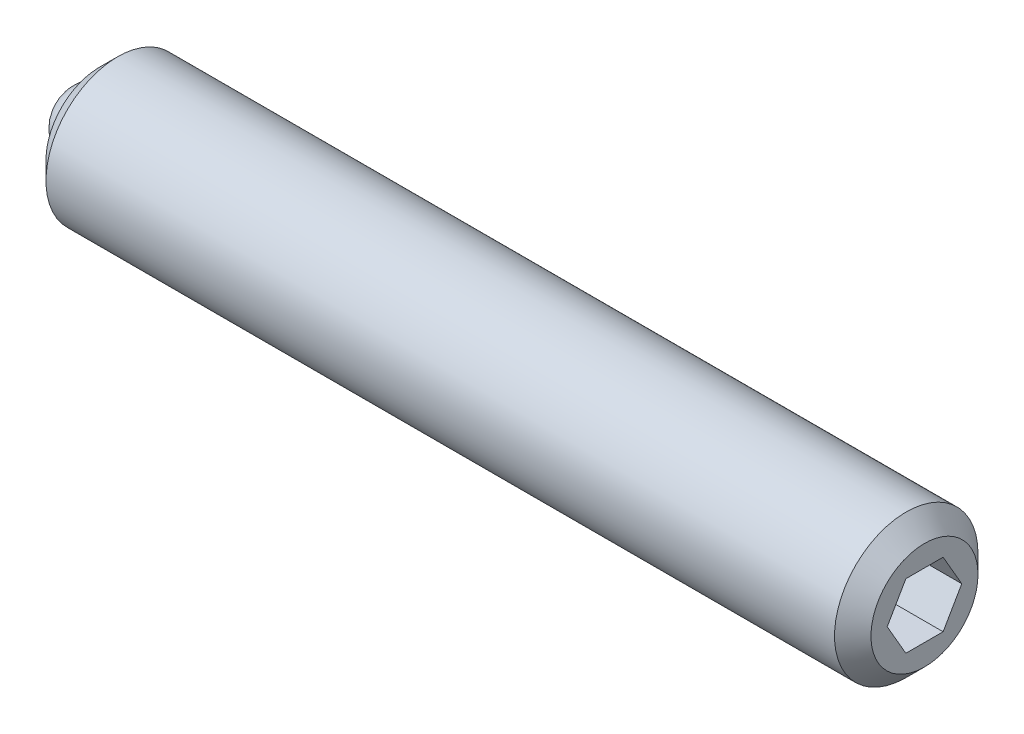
ISO-10303-21;
HEADER;
FILE_DESCRIPTION(('STEP AP214'),'2;1');
FILE_NAME('part.step','',(''),(''),'','','');
FILE_SCHEMA(('AUTOMOTIVE_DESIGN { 1 0 10303 214 1 1 1 1 }'));
ENDSEC;
DATA;
#1=APPLICATION_CONTEXT('core data for automotive mechanical design processes');
#2=APPLICATION_PROTOCOL_DEFINITION('international standard','automotive_design',2000,#1);
#3=PRODUCT_CONTEXT('',#1,'mechanical');
#4=PRODUCT('Part','Part','',(#3));
#5=PRODUCT_RELATED_PRODUCT_CATEGORY('part','',(#4));
#6=PRODUCT_DEFINITION_FORMATION('','',#4);
#7=PRODUCT_DEFINITION_CONTEXT('part definition',#1,'design');
#8=PRODUCT_DEFINITION('design','',#6,#7);
#9=PRODUCT_DEFINITION_SHAPE('','',#8);
#10=(LENGTH_UNIT() NAMED_UNIT(*) SI_UNIT(.MILLI.,.METRE.));
#11=(NAMED_UNIT(*) PLANE_ANGLE_UNIT() SI_UNIT($,.RADIAN.));
#12=(NAMED_UNIT(*) SI_UNIT($,.STERADIAN.) SOLID_ANGLE_UNIT());
#13=UNCERTAINTY_MEASURE_WITH_UNIT(LENGTH_MEASURE(1.E-05),#10,'distance_accuracy_value','');
#14=(GEOMETRIC_REPRESENTATION_CONTEXT(3) GLOBAL_UNCERTAINTY_ASSIGNED_CONTEXT((#13)) GLOBAL_UNIT_ASSIGNED_CONTEXT((#10,
#11,#12)) REPRESENTATION_CONTEXT('',''));
#15=CARTESIAN_POINT('',(0.,0.,0.));
#16=DIRECTION('',(0.,0.,1.));
#17=DIRECTION('',(1.,0.,0.));
#18=AXIS2_PLACEMENT_3D('',#15,#16,#17);
#19=CARTESIAN_POINT('',(0.,0.,0.));
#20=DIRECTION('',(0.,-1.,0.));
#21=DIRECTION('',(0.,0.,-1.));
#22=AXIS2_PLACEMENT_3D('',#19,#20,#21);
#23=SPHERICAL_SURFACE('',#22,0.5);
#24=CARTESIAN_POINT('',(0.,-0.5,0.));
#25=VERTEX_POINT('',#24);
#26=VERTEX_LOOP('',#25);
#27=FACE_BOUND('',#26,.T.);
#28=ADVANCED_FACE('F41',(#27),#23,.T.);
#29=CLOSED_SHELL('',(#28));
#30=MANIFOLD_SOLID_BREP('B2',#29);
#31=CARTESIAN_POINT('',(11.5,0.,0.));
#32=DIRECTION('',(-1.,0.,0.));
#33=DIRECTION('',(0.,0.,1.));
#34=AXIS2_PLACEMENT_3D('',#31,#32,#33);
#35=CYLINDRICAL_SURFACE('',#34,1.);
#36=CARTESIAN_POINT('',(11.246,0.,0.));
#37=DIRECTION('',(1.,0.,0.));
#38=DIRECTION('',(0.,0.,-1.));
#39=AXIS2_PLACEMENT_3D('',#36,#37,#38);
#40=CIRCLE('',#39,1.);
#41=CARTESIAN_POINT('',(11.246,0.,-1.));
#42=VERTEX_POINT('',#41);
#43=EDGE_CURVE('E39',#42,#42,#40,.F.);
#44=ORIENTED_EDGE('',*,*,#43,.T.);
#45=EDGE_LOOP('',(#44));
#46=FACE_BOUND('',#45,.T.);
#47=CARTESIAN_POINT('',(0.254000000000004,0.,0.));
#48=DIRECTION('',(1.,0.,0.));
#49=DIRECTION('',(0.,0.,-1.));
#50=AXIS2_PLACEMENT_3D('',#47,#48,#49);
#51=CIRCLE('',#50,1.);
#52=CARTESIAN_POINT('',(0.254000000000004,0.,-1.));
#53=VERTEX_POINT('',#52);
#54=EDGE_CURVE('E157',#53,#53,#51,.T.);
#55=ORIENTED_EDGE('',*,*,#54,.T.);
#56=EDGE_LOOP('',(#55));
#57=FACE_BOUND('',#56,.T.);
#58=ADVANCED_FACE('F54',(#46,#57),#35,.T.);
#59=CARTESIAN_POINT('',(11.5,0.,0.));
#60=DIRECTION('',(1.,0.,0.));
#61=DIRECTION('',(0.,0.,-1.));
#62=AXIS2_PLACEMENT_3D('',#59,#60,#61);
#63=PLANE('',#62);
#64=DIRECTION('',(0.,0.866025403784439,-0.5));
#65=VECTOR('',#64,1.);
#66=CARTESIAN_POINT('',(11.5,-0.45,-0.259807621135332));
#67=LINE('',#66,#65);
#68=CARTESIAN_POINT('',(11.5,-0.45,-0.259807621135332));
#69=VERTEX_POINT('',#68);
#70=CARTESIAN_POINT('',(11.5,0.,-0.519615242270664));
#71=VERTEX_POINT('',#70);
#72=EDGE_CURVE('E69',#69,#71,#67,.T.);
#73=ORIENTED_EDGE('',*,*,#72,.F.);
#74=DIRECTION('',(0.,0.,-1.));
#75=VECTOR('',#74,1.);
#76=CARTESIAN_POINT('',(11.5,-0.45,0.259807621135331));
#77=LINE('',#76,#75);
#78=CARTESIAN_POINT('',(11.5,-0.45,0.259807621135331));
#79=VERTEX_POINT('',#78);
#80=EDGE_CURVE('E153',#79,#69,#77,.T.);
#81=ORIENTED_EDGE('',*,*,#80,.F.);
#82=DIRECTION('',(0.,-0.866025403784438,-0.5));
#83=VECTOR('',#82,1.);
#84=CARTESIAN_POINT('',(11.5,0.,0.519615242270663));
#85=LINE('',#84,#83);
#86=CARTESIAN_POINT('',(11.5,0.,0.519615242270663));
#87=VERTEX_POINT('',#86);
#88=EDGE_CURVE('E151',#87,#79,#85,.T.);
#89=ORIENTED_EDGE('',*,*,#88,.F.);
#90=DIRECTION('',(0.,-0.866025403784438,0.5));
#91=VECTOR('',#90,1.);
#92=CARTESIAN_POINT('',(11.5,0.45,0.259807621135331));
#93=LINE('',#92,#91);
#94=CARTESIAN_POINT('',(11.5,0.45,0.259807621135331));
#95=VERTEX_POINT('',#94);
#96=EDGE_CURVE('E117',#95,#87,#93,.T.);
#97=ORIENTED_EDGE('',*,*,#96,.F.);
#98=DIRECTION('',(0.,0.,1.));
#99=VECTOR('',#98,1.);
#100=CARTESIAN_POINT('',(11.5,0.45,-0.259807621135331));
#101=LINE('',#100,#99);
#102=CARTESIAN_POINT('',(11.5,0.45,-0.259807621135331));
#103=VERTEX_POINT('',#102);
#104=EDGE_CURVE('E147',#103,#95,#101,.T.);
#105=ORIENTED_EDGE('',*,*,#104,.F.);
#106=DIRECTION('',(0.,0.866025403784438,0.5));
#107=VECTOR('',#106,1.);
#108=CARTESIAN_POINT('',(11.5,0.,-0.519615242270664));
#109=LINE('',#108,#107);
#110=EDGE_CURVE('E143',#71,#103,#109,.T.);
#111=ORIENTED_EDGE('',*,*,#110,.F.);
#112=EDGE_LOOP('',(#73,#81,#89,#97,#105,#111));
#113=FACE_BOUND('',#112,.T.);
#114=CARTESIAN_POINT('',(11.5,0.,0.));
#115=DIRECTION('',(1.,0.,0.));
#116=DIRECTION('',(0.,0.,-1.));
#117=AXIS2_PLACEMENT_3D('',#114,#115,#116);
#118=CIRCLE('',#117,0.745999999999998);
#119=CARTESIAN_POINT('',(11.5,0.,-0.745999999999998));
#120=VERTEX_POINT('',#119);
#121=EDGE_CURVE('E62',#120,#120,#118,.T.);
#122=ORIENTED_EDGE('',*,*,#121,.T.);
#123=EDGE_LOOP('',(#122));
#124=FACE_BOUND('',#123,.T.);
#125=ADVANCED_FACE('F170',(#113,#124),#63,.T.);
#126=CARTESIAN_POINT('',(0.,0.,0.));
#127=DIRECTION('',(1.,0.,0.));
#128=DIRECTION('',(0.,0.,-1.));
#129=AXIS2_PLACEMENT_3D('',#126,#127,#128);
#130=PLANE('',#129);
#131=CARTESIAN_POINT('',(0.,0.,0.));
#132=DIRECTION('',(-1.,0.,0.));
#133=DIRECTION('',(0.,0.,1.));
#134=AXIS2_PLACEMENT_3D('',#131,#132,#133);
#135=CIRCLE('',#134,0.5);
#136=CARTESIAN_POINT('',(0.,0.,0.5));
#137=VERTEX_POINT('',#136);
#138=EDGE_CURVE('E225',#137,#137,#135,.T.);
#139=ORIENTED_EDGE('',*,*,#138,.F.);
#140=EDGE_LOOP('',(#139));
#141=FACE_BOUND('',#140,.T.);
#142=CARTESIAN_POINT('',(0.,0.,0.));
#143=DIRECTION('',(1.,0.,0.));
#144=DIRECTION('',(0.,0.,-1.));
#145=AXIS2_PLACEMENT_3D('',#142,#143,#144);
#146=CIRCLE('',#145,0.745999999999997);
#147=CARTESIAN_POINT('',(0.,0.,-0.745999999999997));
#148=VERTEX_POINT('',#147);
#149=EDGE_CURVE('E165',#148,#148,#146,.F.);
#150=ORIENTED_EDGE('',*,*,#149,.T.);
#151=EDGE_LOOP('',(#150));
#152=FACE_BOUND('',#151,.T.);
#153=ADVANCED_FACE('F182',(#141,#152),#130,.F.);
#154=CARTESIAN_POINT('',(0.254000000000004,0.,0.));
#155=DIRECTION('',(1.,0.,0.));
#156=DIRECTION('',(0.,0.,-1.));
#157=AXIS2_PLACEMENT_3D('',#154,#155,#156);
#158=CONICAL_SURFACE('',#157,1.,0.785398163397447);
#159=ORIENTED_EDGE('',*,*,#149,.F.);
#160=EDGE_LOOP('',(#159));
#161=FACE_BOUND('',#160,.T.);
#162=ORIENTED_EDGE('',*,*,#54,.F.);
#163=EDGE_LOOP('',(#162));
#164=FACE_BOUND('',#163,.T.);
#165=ADVANCED_FACE('F174',(#161,#164),#158,.T.);
#166=CARTESIAN_POINT('',(11.5,0.,0.));
#167=DIRECTION('',(-1.,0.,0.));
#168=DIRECTION('',(0.,0.,1.));
#169=AXIS2_PLACEMENT_3D('',#166,#167,#168);
#170=CONICAL_SURFACE('',#169,0.745999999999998,0.785398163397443);
#171=ORIENTED_EDGE('',*,*,#43,.F.);
#172=EDGE_LOOP('',(#171));
#173=FACE_BOUND('',#172,.T.);
#174=ORIENTED_EDGE('',*,*,#121,.F.);
#175=EDGE_LOOP('',(#174));
#176=FACE_BOUND('',#175,.T.);
#177=ADVANCED_FACE('F56',(#173,#176),#170,.T.);
#178=CARTESIAN_POINT('',(9.5,-0.45,-0.259807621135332));
#179=DIRECTION('',(0.,-0.5,-0.866025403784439));
#180=DIRECTION('',(0.,0.866025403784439,-0.5));
#181=AXIS2_PLACEMENT_3D('',#178,#179,#180);
#182=PLANE('',#181);
#183=ORIENTED_EDGE('',*,*,#72,.T.);
#184=DIRECTION('',(1.,0.,0.));
#185=VECTOR('',#184,1.);
#186=CARTESIAN_POINT('',(9.5,0.,-0.519615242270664));
#187=LINE('',#186,#185);
#188=CARTESIAN_POINT('',(9.5,0.,-0.519615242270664));
#189=VERTEX_POINT('',#188);
#190=EDGE_CURVE('E99',#189,#71,#187,.T.);
#191=ORIENTED_EDGE('',*,*,#190,.F.);
#192=DIRECTION('',(0.,0.866025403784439,-0.5));
#193=VECTOR('',#192,1.);
#194=CARTESIAN_POINT('',(9.5,-0.45,-0.259807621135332));
#195=LINE('',#194,#193);
#196=CARTESIAN_POINT('',(9.5,-0.45,-0.259807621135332));
#197=VERTEX_POINT('',#196);
#198=EDGE_CURVE('E155',#197,#189,#195,.T.);
#199=ORIENTED_EDGE('',*,*,#198,.F.);
#200=DIRECTION('',(1.,0.,0.));
#201=VECTOR('',#200,1.);
#202=CARTESIAN_POINT('',(9.5,-0.45,-0.259807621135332));
#203=LINE('',#202,#201);
#204=EDGE_CURVE('E77',#197,#69,#203,.T.);
#205=ORIENTED_EDGE('',*,*,#204,.T.);
#206=EDGE_LOOP('',(#183,#191,#199,#205));
#207=FACE_BOUND('',#206,.T.);
#208=ADVANCED_FACE('F173',(#207),#182,.F.);
#209=CARTESIAN_POINT('',(9.5,-0.45,0.259807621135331));
#210=DIRECTION('',(0.,-1.,0.));
#211=DIRECTION('',(0.,0.,-1.));
#212=AXIS2_PLACEMENT_3D('',#209,#210,#211);
#213=PLANE('',#212);
#214=ORIENTED_EDGE('',*,*,#80,.T.);
#215=ORIENTED_EDGE('',*,*,#204,.F.);
#216=DIRECTION('',(0.,0.,-1.));
#217=VECTOR('',#216,1.);
#218=CARTESIAN_POINT('',(9.5,-0.45,0.259807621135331));
#219=LINE('',#218,#217);
#220=CARTESIAN_POINT('',(9.5,-0.45,0.259807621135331));
#221=VERTEX_POINT('',#220);
#222=EDGE_CURVE('E129',#221,#197,#219,.T.);
#223=ORIENTED_EDGE('',*,*,#222,.F.);
#224=DIRECTION('',(1.,0.,0.));
#225=VECTOR('',#224,1.);
#226=CARTESIAN_POINT('',(9.5,-0.45,0.259807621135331));
#227=LINE('',#226,#225);
#228=EDGE_CURVE('E121',#221,#79,#227,.T.);
#229=ORIENTED_EDGE('',*,*,#228,.T.);
#230=EDGE_LOOP('',(#214,#215,#223,#229));
#231=FACE_BOUND('',#230,.T.);
#232=ADVANCED_FACE('F180',(#231),#213,.F.);
#233=CARTESIAN_POINT('',(9.5,0.,0.519615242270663));
#234=DIRECTION('',(0.,-0.5,0.866025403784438));
#235=DIRECTION('',(0.,-0.866025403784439,-0.5));
#236=AXIS2_PLACEMENT_3D('',#233,#234,#235);
#237=PLANE('',#236);
#238=ORIENTED_EDGE('',*,*,#88,.T.);
#239=ORIENTED_EDGE('',*,*,#228,.F.);
#240=DIRECTION('',(0.,-0.866025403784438,-0.5));
#241=VECTOR('',#240,1.);
#242=CARTESIAN_POINT('',(9.5,0.,0.519615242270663));
#243=LINE('',#242,#241);
#244=CARTESIAN_POINT('',(9.5,0.,0.519615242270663));
#245=VERTEX_POINT('',#244);
#246=EDGE_CURVE('E125',#245,#221,#243,.T.);
#247=ORIENTED_EDGE('',*,*,#246,.F.);
#248=DIRECTION('',(1.,0.,0.));
#249=VECTOR('',#248,1.);
#250=CARTESIAN_POINT('',(9.5,0.,0.519615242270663));
#251=LINE('',#250,#249);
#252=EDGE_CURVE('E110',#245,#87,#251,.T.);
#253=ORIENTED_EDGE('',*,*,#252,.T.);
#254=EDGE_LOOP('',(#238,#239,#247,#253));
#255=FACE_BOUND('',#254,.T.);
#256=ADVANCED_FACE('F126',(#255),#237,.F.);
#257=CARTESIAN_POINT('',(9.5,0.45,0.259807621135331));
#258=DIRECTION('',(0.,0.5,0.866025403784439));
#259=DIRECTION('',(0.,-0.866025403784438,0.5));
#260=AXIS2_PLACEMENT_3D('',#257,#258,#259);
#261=PLANE('',#260);
#262=ORIENTED_EDGE('',*,*,#96,.T.);
#263=ORIENTED_EDGE('',*,*,#252,.F.);
#264=DIRECTION('',(0.,-0.866025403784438,0.5));
#265=VECTOR('',#264,1.);
#266=CARTESIAN_POINT('',(9.5,0.45,0.259807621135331));
#267=LINE('',#266,#265);
#268=CARTESIAN_POINT('',(9.5,0.45,0.259807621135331));
#269=VERTEX_POINT('',#268);
#270=EDGE_CURVE('E114',#269,#245,#267,.T.);
#271=ORIENTED_EDGE('',*,*,#270,.F.);
#272=DIRECTION('',(1.,0.,0.));
#273=VECTOR('',#272,1.);
#274=CARTESIAN_POINT('',(9.5,0.45,0.259807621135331));
#275=LINE('',#274,#273);
#276=EDGE_CURVE('E122',#269,#95,#275,.T.);
#277=ORIENTED_EDGE('',*,*,#276,.T.);
#278=EDGE_LOOP('',(#262,#263,#271,#277));
#279=FACE_BOUND('',#278,.T.);
#280=ADVANCED_FACE('F112',(#279),#261,.F.);
#281=CARTESIAN_POINT('',(9.5,0.45,-0.259807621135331));
#282=DIRECTION('',(0.,1.,0.));
#283=DIRECTION('',(0.,0.,1.));
#284=AXIS2_PLACEMENT_3D('',#281,#282,#283);
#285=PLANE('',#284);
#286=ORIENTED_EDGE('',*,*,#104,.T.);
#287=ORIENTED_EDGE('',*,*,#276,.F.);
#288=DIRECTION('',(0.,0.,1.));
#289=VECTOR('',#288,1.);
#290=CARTESIAN_POINT('',(9.5,0.45,-0.259807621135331));
#291=LINE('',#290,#289);
#292=CARTESIAN_POINT('',(9.5,0.45,-0.259807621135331));
#293=VERTEX_POINT('',#292);
#294=EDGE_CURVE('E135',#293,#269,#291,.T.);
#295=ORIENTED_EDGE('',*,*,#294,.F.);
#296=DIRECTION('',(1.,0.,0.));
#297=VECTOR('',#296,1.);
#298=CARTESIAN_POINT('',(9.5,0.45,-0.259807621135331));
#299=LINE('',#298,#297);
#300=EDGE_CURVE('E160',#293,#103,#299,.T.);
#301=ORIENTED_EDGE('',*,*,#300,.T.);
#302=EDGE_LOOP('',(#286,#287,#295,#301));
#303=FACE_BOUND('',#302,.T.);
#304=ADVANCED_FACE('F201',(#303),#285,.F.);
#305=CARTESIAN_POINT('',(9.5,0.,-0.519615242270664));
#306=DIRECTION('',(0.,0.5,-0.866025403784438));
#307=DIRECTION('',(0.,0.866025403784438,0.5));
#308=AXIS2_PLACEMENT_3D('',#305,#306,#307);
#309=PLANE('',#308);
#310=ORIENTED_EDGE('',*,*,#110,.T.);
#311=ORIENTED_EDGE('',*,*,#300,.F.);
#312=DIRECTION('',(0.,0.866025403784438,0.5));
#313=VECTOR('',#312,1.);
#314=CARTESIAN_POINT('',(9.5,0.,-0.519615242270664));
#315=LINE('',#314,#313);
#316=EDGE_CURVE('E137',#189,#293,#315,.T.);
#317=ORIENTED_EDGE('',*,*,#316,.F.);
#318=ORIENTED_EDGE('',*,*,#190,.T.);
#319=EDGE_LOOP('',(#310,#311,#317,#318));
#320=FACE_BOUND('',#319,.T.);
#321=ADVANCED_FACE('F198',(#320),#309,.F.);
#322=CARTESIAN_POINT('',(9.5,0.,0.));
#323=DIRECTION('',(1.,0.,0.));
#324=DIRECTION('',(0.,0.,-1.));
#325=AXIS2_PLACEMENT_3D('',#322,#323,#324);
#326=PLANE('',#325);
#327=ORIENTED_EDGE('',*,*,#198,.T.);
#328=ORIENTED_EDGE('',*,*,#316,.T.);
#329=ORIENTED_EDGE('',*,*,#294,.T.);
#330=ORIENTED_EDGE('',*,*,#270,.T.);
#331=ORIENTED_EDGE('',*,*,#246,.T.);
#332=ORIENTED_EDGE('',*,*,#222,.T.);
#333=EDGE_LOOP('',(#327,#328,#329,#330,#331,#332));
#334=FACE_BOUND('',#333,.T.);
#335=ADVANCED_FACE('F132',(#334),#326,.T.);
#336=CARTESIAN_POINT('',(0.5,0.,0.));
#337=DIRECTION('',(-1.,0.,0.));
#338=DIRECTION('',(0.,0.,1.));
#339=AXIS2_PLACEMENT_3D('',#336,#337,#338);
#340=CYLINDRICAL_SURFACE('',#339,0.5);
#341=CARTESIAN_POINT('',(0.5,0.,0.));
#342=DIRECTION('',(-1.,0.,0.));
#343=DIRECTION('',(0.,0.,1.));
#344=AXIS2_PLACEMENT_3D('',#341,#342,#343);
#345=CIRCLE('',#344,0.5);
#346=CARTESIAN_POINT('',(0.5,0.,0.5));
#347=VERTEX_POINT('',#346);
#348=EDGE_CURVE('E144',#347,#347,#345,.T.);
#349=ORIENTED_EDGE('',*,*,#348,.F.);
#350=EDGE_LOOP('',(#349));
#351=FACE_BOUND('',#350,.T.);
#352=ORIENTED_EDGE('',*,*,#138,.T.);
#353=EDGE_LOOP('',(#352));
#354=FACE_BOUND('',#353,.T.);
#355=ADVANCED_FACE('F214',(#351,#354),#340,.F.);
#356=CARTESIAN_POINT('',(0.5,0.,0.));
#357=DIRECTION('',(-1.,0.,0.));
#358=DIRECTION('',(0.,0.,1.));
#359=AXIS2_PLACEMENT_3D('',#356,#357,#358);
#360=PLANE('',#359);
#361=ORIENTED_EDGE('',*,*,#348,.T.);
#362=EDGE_LOOP('',(#361));
#363=FACE_BOUND('',#362,.T.);
#364=ADVANCED_FACE('F217',(#363),#360,.T.);
#365=CLOSED_SHELL('',(#58,#125,#153,#165,#177,#208,#232,#256,#280,#304,#321,#335,#355,#364));
#366=MANIFOLD_SOLID_BREP('B6',#365);
#367=ADVANCED_BREP_SHAPE_REPRESENTATION('',(#18,#30,#366),#14);
#368=SHAPE_DEFINITION_REPRESENTATION(#9,#367);
ENDSEC;
END-ISO-10303-21;
